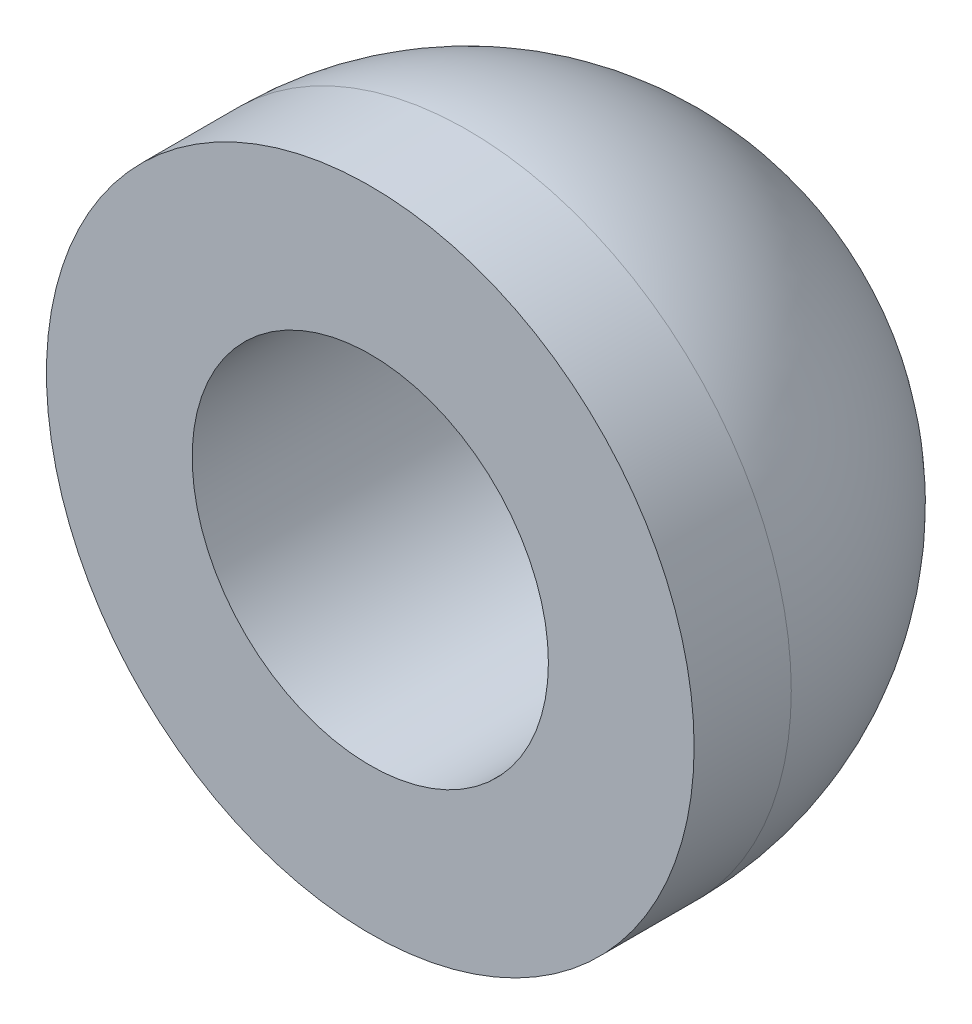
ISO-10303-21;
HEADER;
FILE_DESCRIPTION(('STEP AP214'),'2;1');
FILE_NAME('part.step','',(''),(''),'','','');
FILE_SCHEMA(('AUTOMOTIVE_DESIGN { 1 0 10303 214 1 1 1 1 }'));
ENDSEC;
DATA;
#1=APPLICATION_CONTEXT('core data for automotive mechanical design processes');
#2=APPLICATION_PROTOCOL_DEFINITION('international standard','automotive_design',2000,#1);
#3=PRODUCT_CONTEXT('',#1,'mechanical');
#4=PRODUCT('Part','Part','',(#3));
#5=PRODUCT_RELATED_PRODUCT_CATEGORY('part','',(#4));
#6=PRODUCT_DEFINITION_FORMATION('','',#4);
#7=PRODUCT_DEFINITION_CONTEXT('part definition',#1,'design');
#8=PRODUCT_DEFINITION('design','',#6,#7);
#9=PRODUCT_DEFINITION_SHAPE('','',#8);
#10=(LENGTH_UNIT() NAMED_UNIT(*) SI_UNIT(.MILLI.,.METRE.));
#11=(NAMED_UNIT(*) PLANE_ANGLE_UNIT() SI_UNIT($,.RADIAN.));
#12=(NAMED_UNIT(*) SI_UNIT($,.STERADIAN.) SOLID_ANGLE_UNIT());
#13=UNCERTAINTY_MEASURE_WITH_UNIT(LENGTH_MEASURE(1.E-05),#10,'distance_accuracy_value','');
#14=(GEOMETRIC_REPRESENTATION_CONTEXT(3) GLOBAL_UNCERTAINTY_ASSIGNED_CONTEXT((#13)) GLOBAL_UNIT_ASSIGNED_CONTEXT((#10,
#11,#12)) REPRESENTATION_CONTEXT('',''));
#15=CARTESIAN_POINT('',(0.,0.,0.));
#16=DIRECTION('',(0.,0.,1.));
#17=DIRECTION('',(1.,0.,0.));
#18=AXIS2_PLACEMENT_3D('',#15,#16,#17);
#19=CARTESIAN_POINT('',(0.,2.75,0.));
#20=DIRECTION('',(0.,0.,-1.));
#21=DIRECTION('',(-1.,0.,0.));
#22=AXIS2_PLACEMENT_3D('',#19,#20,#21);
#23=PLANE('',#22);
#24=CARTESIAN_POINT('',(0.,0.,0.));
#25=DIRECTION('',(0.,0.,1.));
#26=DIRECTION('',(1.,0.,0.));
#27=AXIS2_PLACEMENT_3D('',#24,#25,#26);
#28=CIRCLE('',#27,2.75);
#29=CARTESIAN_POINT('',(2.75,0.,0.));
#30=VERTEX_POINT('',#29);
#31=EDGE_CURVE('E10',#30,#30,#28,.T.);
#32=ORIENTED_EDGE('',*,*,#31,.F.);
#33=EDGE_LOOP('',(#32));
#34=FACE_BOUND('',#33,.T.);
#35=CARTESIAN_POINT('',(0.,0.,0.));
#36=DIRECTION('',(0.,0.,1.));
#37=DIRECTION('',(1.,0.,0.));
#38=AXIS2_PLACEMENT_3D('',#35,#36,#37);
#39=CIRCLE('',#38,5.);
#40=CARTESIAN_POINT('',(5.,0.,0.));
#41=VERTEX_POINT('',#40);
#42=EDGE_CURVE('E36',#41,#41,#39,.T.);
#43=ORIENTED_EDGE('',*,*,#42,.T.);
#44=EDGE_LOOP('',(#43));
#45=FACE_BOUND('',#44,.T.);
#46=ADVANCED_FACE('F25',(#34,#45),#23,.F.);
#47=CARTESIAN_POINT('',(0.,0.,0.));
#48=DIRECTION('',(0.,0.,1.));
#49=DIRECTION('',(1.,0.,0.));
#50=AXIS2_PLACEMENT_3D('',#47,#48,#49);
#51=CYLINDRICAL_SURFACE('',#50,2.75);
#52=CARTESIAN_POINT('',(0.,0.,-5.5));
#53=DIRECTION('',(0.,0.,1.));
#54=DIRECTION('',(1.,0.,0.));
#55=AXIS2_PLACEMENT_3D('',#52,#53,#54);
#56=CIRCLE('',#55,2.75);
#57=CARTESIAN_POINT('',(2.75,0.,-5.5));
#58=VERTEX_POINT('',#57);
#59=EDGE_CURVE('E41',#58,#58,#56,.F.);
#60=ORIENTED_EDGE('',*,*,#59,.T.);
#61=EDGE_LOOP('',(#60));
#62=FACE_BOUND('',#61,.T.);
#63=ORIENTED_EDGE('',*,*,#31,.T.);
#64=EDGE_LOOP('',(#63));
#65=FACE_BOUND('',#64,.T.);
#66=ADVANCED_FACE('F63',(#62,#65),#51,.F.);
#67=CARTESIAN_POINT('',(0.,0.,-1.5));
#68=DIRECTION('',(0.,0.,1.));
#69=DIRECTION('',(0.,1.,0.));
#70=AXIS2_PLACEMENT_3D('',#67,#68,#69);
#71=SPHERICAL_SURFACE('',#70,5.);
#72=CARTESIAN_POINT('',(0.,0.,-5.5));
#73=DIRECTION('',(0.,0.,1.));
#74=DIRECTION('',(1.,0.,0.));
#75=AXIS2_PLACEMENT_3D('',#72,#73,#74);
#76=CIRCLE('',#75,3.);
#77=CARTESIAN_POINT('',(3.,0.,-5.5));
#78=VERTEX_POINT('',#77);
#79=EDGE_CURVE('E28',#78,#78,#76,.T.);
#80=ORIENTED_EDGE('',*,*,#79,.T.);
#81=EDGE_LOOP('',(#80));
#82=FACE_BOUND('',#81,.T.);
#83=CARTESIAN_POINT('',(0.,0.,-1.5));
#84=DIRECTION('',(0.,0.,1.));
#85=DIRECTION('',(1.,0.,0.));
#86=AXIS2_PLACEMENT_3D('',#83,#84,#85);
#87=CIRCLE('',#86,5.);
#88=CARTESIAN_POINT('',(5.,0.,-1.5));
#89=VERTEX_POINT('',#88);
#90=EDGE_CURVE('E32',#89,#89,#87,.T.);
#91=ORIENTED_EDGE('',*,*,#90,.F.);
#92=EDGE_LOOP('',(#91));
#93=FACE_BOUND('',#92,.T.);
#94=ADVANCED_FACE('F48',(#82,#93),#71,.T.);
#95=CARTESIAN_POINT('',(0.,0.,0.));
#96=DIRECTION('',(0.,0.,1.));
#97=DIRECTION('',(1.,0.,0.));
#98=AXIS2_PLACEMENT_3D('',#95,#96,#97);
#99=CYLINDRICAL_SURFACE('',#98,5.);
#100=ORIENTED_EDGE('',*,*,#42,.F.);
#101=EDGE_LOOP('',(#100));
#102=FACE_BOUND('',#101,.T.);
#103=ORIENTED_EDGE('',*,*,#90,.T.);
#104=EDGE_LOOP('',(#103));
#105=FACE_BOUND('',#104,.T.);
#106=ADVANCED_FACE('F54',(#102,#105),#99,.T.);
#107=CARTESIAN_POINT('',(0.,0.,-5.5));
#108=DIRECTION('',(0.,0.,1.));
#109=DIRECTION('',(1.,0.,0.));
#110=AXIS2_PLACEMENT_3D('',#107,#108,#109);
#111=PLANE('',#110);
#112=ORIENTED_EDGE('',*,*,#79,.F.);
#113=EDGE_LOOP('',(#112));
#114=FACE_BOUND('',#113,.T.);
#115=ORIENTED_EDGE('',*,*,#59,.F.);
#116=EDGE_LOOP('',(#115));
#117=FACE_BOUND('',#116,.T.);
#118=ADVANCED_FACE('F51',(#114,#117),#111,.F.);
#119=CLOSED_SHELL('',(#46,#66,#94,#106,#118));
#120=MANIFOLD_SOLID_BREP('B2',#119);
#121=ADVANCED_BREP_SHAPE_REPRESENTATION('',(#18,#120),#14);
#122=SHAPE_DEFINITION_REPRESENTATION(#9,#121);
ENDSEC;
END-ISO-10303-21;
